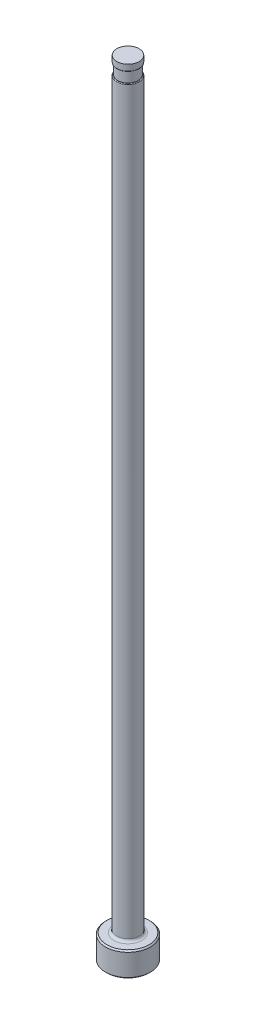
ISO-10303-21;
HEADER;
FILE_DESCRIPTION(('STEP AP214'),'2;1');
FILE_NAME('part.step','',(''),(''),'','','');
FILE_SCHEMA(('AUTOMOTIVE_DESIGN { 1 0 10303 214 1 1 1 1 }'));
ENDSEC;
DATA;
#1=APPLICATION_CONTEXT('core data for automotive mechanical design processes');
#2=APPLICATION_PROTOCOL_DEFINITION('international standard','automotive_design',2000,#1);
#3=PRODUCT_CONTEXT('',#1,'mechanical');
#4=PRODUCT('Part','Part','',(#3));
#5=PRODUCT_RELATED_PRODUCT_CATEGORY('part','',(#4));
#6=PRODUCT_DEFINITION_FORMATION('','',#4);
#7=PRODUCT_DEFINITION_CONTEXT('part definition',#1,'design');
#8=PRODUCT_DEFINITION('design','',#6,#7);
#9=PRODUCT_DEFINITION_SHAPE('','',#8);
#10=(LENGTH_UNIT() NAMED_UNIT(*) SI_UNIT(.MILLI.,.METRE.));
#11=(NAMED_UNIT(*) PLANE_ANGLE_UNIT() SI_UNIT($,.RADIAN.));
#12=(NAMED_UNIT(*) SI_UNIT($,.STERADIAN.) SOLID_ANGLE_UNIT());
#13=UNCERTAINTY_MEASURE_WITH_UNIT(LENGTH_MEASURE(1.E-05),#10,'distance_accuracy_value','');
#14=(GEOMETRIC_REPRESENTATION_CONTEXT(3) GLOBAL_UNCERTAINTY_ASSIGNED_CONTEXT((#13)) GLOBAL_UNIT_ASSIGNED_CONTEXT((#10,
#11,#12)) REPRESENTATION_CONTEXT('',''));
#15=CARTESIAN_POINT('',(0.,0.,0.));
#16=DIRECTION('',(0.,0.,1.));
#17=DIRECTION('',(1.,0.,0.));
#18=AXIS2_PLACEMENT_3D('',#15,#16,#17);
#19=CARTESIAN_POINT('',(-2.18185999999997,151.13,0.));
#20=DIRECTION('',(0.,1.,0.));
#21=DIRECTION('',(0.,0.,1.));
#22=AXIS2_PLACEMENT_3D('',#19,#20,#21);
#23=PLANE('',#22);
#24=CARTESIAN_POINT('',(0.,151.13,0.));
#25=DIRECTION('',(0.,1.,0.));
#26=DIRECTION('',(0.,0.,1.));
#27=AXIS2_PLACEMENT_3D('',#24,#25,#26);
#28=CIRCLE('',#27,2.04215999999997);
#29=CARTESIAN_POINT('',(0.,151.13,2.04215999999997));
#30=VERTEX_POINT('',#29);
#31=EDGE_CURVE('E11',#30,#30,#28,.F.);
#32=ORIENTED_EDGE('',*,*,#31,.T.);
#33=EDGE_LOOP('',(#32));
#34=FACE_BOUND('',#33,.T.);
#35=CARTESIAN_POINT('',(0.,151.13,0.));
#36=DIRECTION('',(0.,1.,0.));
#37=DIRECTION('',(0.,0.,1.));
#38=AXIS2_PLACEMENT_3D('',#35,#36,#37);
#39=CIRCLE('',#38,1.97865999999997);
#40=CARTESIAN_POINT('',(0.,151.13,1.97865999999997));
#41=VERTEX_POINT('',#40);
#42=EDGE_CURVE('E78',#41,#41,#39,.T.);
#43=ORIENTED_EDGE('',*,*,#42,.T.);
#44=EDGE_LOOP('',(#43));
#45=FACE_BOUND('',#44,.T.);
#46=ADVANCED_FACE('F36',(#34,#45),#23,.F.);
#47=CARTESIAN_POINT('',(0.,259.958771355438,0.));
#48=DIRECTION('',(0.,1.,0.));
#49=DIRECTION('',(0.,0.,1.));
#50=AXIS2_PLACEMENT_3D('',#47,#48,#49);
#51=CYLINDRICAL_SURFACE('',#50,2.18185999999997);
#52=DIRECTION('',(0.,1.,0.));
#53=VECTOR('',#52,1.);
#54=CARTESIAN_POINT('',(-1.97865999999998,259.958771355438,-0.919465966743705));
#55=LINE('',#54,#53);
#56=CARTESIAN_POINT('',(-1.97865999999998,148.971,-0.919465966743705));
#57=VERTEX_POINT('',#56);
#58=CARTESIAN_POINT('',(-1.97865999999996,86.614,-0.919465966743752));
#59=VERTEX_POINT('',#58);
#60=EDGE_CURVE('E73',#57,#59,#55,.F.);
#61=ORIENTED_EDGE('',*,*,#60,.F.);
#62=CARTESIAN_POINT('',(0.,148.971,0.));
#63=DIRECTION('',(0.,-1.,0.));
#64=DIRECTION('',(0.,0.,-1.));
#65=AXIS2_PLACEMENT_3D('',#62,#63,#64);
#66=CIRCLE('',#65,2.18185999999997);
#67=CARTESIAN_POINT('',(-1.97865999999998,148.971,0.919465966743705));
#68=VERTEX_POINT('',#67);
#69=EDGE_CURVE('E51',#57,#68,#66,.T.);
#70=ORIENTED_EDGE('',*,*,#69,.T.);
#71=DIRECTION('',(0.,1.,0.));
#72=VECTOR('',#71,1.);
#73=CARTESIAN_POINT('',(-1.97865999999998,259.958771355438,0.919465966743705));
#74=LINE('',#73,#72);
#75=CARTESIAN_POINT('',(-1.97865999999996,86.614,0.919465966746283));
#76=VERTEX_POINT('',#75);
#77=EDGE_CURVE('E84',#76,#68,#74,.T.);
#78=ORIENTED_EDGE('',*,*,#77,.F.);
#79=CARTESIAN_POINT('',(-1.97865999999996,86.614,-0.919465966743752));
#80=CARTESIAN_POINT('',(-1.97865866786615,86.5826405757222,-0.919462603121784));
#81=CARTESIAN_POINT('',(-1.97912506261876,86.5512918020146,-0.918466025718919));
#82=CARTESIAN_POINT('',(-1.98097751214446,86.4887428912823,-0.914466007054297));
#83=CARTESIAN_POINT('',(-1.98236377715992,86.4575427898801,-0.911462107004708));
#84=CARTESIAN_POINT('',(-1.98789143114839,86.3641571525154,-0.899380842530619));
#85=CARTESIAN_POINT('',(-1.99340148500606,86.302411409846,-0.887233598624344));
#86=CARTESIAN_POINT('',(-2.00766626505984,86.1814900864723,-0.854463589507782));
#87=CARTESIAN_POINT('',(-2.01642631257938,86.1223188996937,-0.833826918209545));
#88=CARTESIAN_POINT('',(-2.03642611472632,86.0083500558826,-0.783714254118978));
#89=CARTESIAN_POINT('',(-2.04766149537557,85.9535449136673,-0.754253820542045));
#90=CARTESIAN_POINT('',(-2.06976532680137,85.8574949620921,-0.691040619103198));
#91=CARTESIAN_POINT('',(-2.08046172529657,85.8154280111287,-0.658480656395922));
#92=CARTESIAN_POINT('',(-2.10182499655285,85.737320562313,-0.586722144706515));
#93=CARTESIAN_POINT('',(-2.11249187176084,85.7012795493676,-0.547524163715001));
#94=CARTESIAN_POINT('',(-2.13268121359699,85.6365154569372,-0.4627024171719));
#95=CARTESIAN_POINT('',(-2.14219477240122,85.6078476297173,-0.417033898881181));
#96=CARTESIAN_POINT('',(-2.15871707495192,85.5596764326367,-0.320671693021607));
#97=CARTESIAN_POINT('',(-2.16572797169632,85.5401651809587,-0.269982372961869));
#98=CARTESIAN_POINT('',(-2.17552234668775,85.5133195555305,-0.172335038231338));
#99=CARTESIAN_POINT('',(-2.17874151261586,85.5047183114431,-0.125766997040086));
#100=CARTESIAN_POINT('',(-2.18213487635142,85.4956577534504,-0.0317428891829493));
#101=CARTESIAN_POINT('',(-2.18231070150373,85.4951940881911,0.0157126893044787));
#102=CARTESIAN_POINT('',(-2.17970850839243,85.5021335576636,0.106163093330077));
#103=CARTESIAN_POINT('',(-2.17716289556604,85.5089177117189,0.149213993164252));
#104=CARTESIAN_POINT('',(-2.16974118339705,85.52911834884,0.233509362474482));
#105=CARTESIAN_POINT('',(-2.16486525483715,85.5425343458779,0.274753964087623));
#106=CARTESIAN_POINT('',(-2.15317272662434,85.5757261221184,0.355008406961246));
#107=CARTESIAN_POINT('',(-2.14632875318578,85.5955921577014,0.393976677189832));
#108=CARTESIAN_POINT('',(-2.13136233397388,85.64090710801,0.46823629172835));
#109=CARTESIAN_POINT('',(-2.12323947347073,85.6663578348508,0.50352643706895));
#110=CARTESIAN_POINT('',(-2.1056031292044,85.7246284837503,0.57302033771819));
#111=CARTESIAN_POINT('',(-2.09603057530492,85.7579136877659,0.606817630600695));
#112=CARTESIAN_POINT('',(-2.07698351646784,85.8291137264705,0.66911560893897));
#113=CARTESIAN_POINT('',(-2.0675090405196,85.8670298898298,0.6976147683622));
#114=CARTESIAN_POINT('',(-2.04798045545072,85.9525059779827,0.75318377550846));
#115=CARTESIAN_POINT('',(-2.03805488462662,86.0006575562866,0.779387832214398));
#116=CARTESIAN_POINT('',(-2.02005215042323,86.100471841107,0.824924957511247));
#117=CARTESIAN_POINT('',(-2.01197798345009,86.1521400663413,0.844246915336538));
#118=CARTESIAN_POINT('',(-1.99655433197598,86.2709127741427,0.880207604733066));
#119=CARTESIAN_POINT('',(-1.98987802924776,86.3386743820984,0.895000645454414));
#120=CARTESIAN_POINT('',(-1.98316702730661,86.4414162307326,0.909716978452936));
#121=CARTESIAN_POINT('',(-1.98148063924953,86.4758147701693,0.91337694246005));
#122=CARTESIAN_POINT('',(-1.97922666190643,86.5448033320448,0.918247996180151));
#123=CARTESIAN_POINT('',(-1.97865847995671,86.5793932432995,0.91946038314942));
#124=CARTESIAN_POINT('',(-1.97865999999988,86.6139999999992,0.919465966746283));
#125=B_SPLINE_CURVE_WITH_KNOTS('',3,(#79,#80,#81,#82,#83,#84,#85,#86,#87,#88,#89,#90,#91,#92,
#93,#94,#95,#96,#97,#98,#99,#100,#101,#102,#103,#104,#105,#106,#107,#108,#109,#110,#111,#112,
#113,#114,#115,#116,#117,#118,#119,#120,#121,#122,#123,#124),.UNSPECIFIED.,.F.,.F.,(4,2,2,2,2,2,
2,2,2,2,2,2,2,2,2,2,2,2,2,2,2,2,4),(0.,0.0940372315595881,0.188095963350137,0.376882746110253,
0.565980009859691,0.754745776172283,0.916867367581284,1.07897509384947,1.24226436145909,
1.40541281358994,1.54703759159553,1.68858663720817,1.8189460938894,1.94929599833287,
2.08155476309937,2.21385650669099,2.35846583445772,2.50311675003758,2.66961219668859,
2.83637523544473,3.04438491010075,3.1481998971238,3.25195984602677),.UNSPECIFIED.);
#126=EDGE_CURVE('E81',#59,#76,#125,.T.);
#127=ORIENTED_EDGE('',*,*,#126,.F.);
#128=EDGE_LOOP('',(#61,#70,#78,#127));
#129=FACE_BOUND('',#128,.T.);
#130=CARTESIAN_POINT('',(0.,5.25779999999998,0.));
#131=DIRECTION('',(0.,1.,0.));
#132=DIRECTION('',(0.,0.,1.));
#133=AXIS2_PLACEMENT_3D('',#130,#131,#132);
#134=CIRCLE('',#133,2.18185999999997);
#135=CARTESIAN_POINT('',(0.,5.25779999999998,2.18185999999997));
#136=VERTEX_POINT('',#135);
#137=EDGE_CURVE('E116',#136,#136,#134,.T.);
#138=ORIENTED_EDGE('',*,*,#137,.T.);
#139=EDGE_LOOP('',(#138));
#140=FACE_BOUND('',#139,.T.);
#141=ADVANCED_FACE('F82',(#129,#140),#51,.T.);
#142=CARTESIAN_POINT('',(0.,0.,0.));
#143=DIRECTION('',(0.,-1.,0.));
#144=DIRECTION('',(0.,0.,-1.));
#145=AXIS2_PLACEMENT_3D('',#142,#143,#144);
#146=PLANE('',#145);
#147=CARTESIAN_POINT('',(0.,0.,0.));
#148=DIRECTION('',(0.,-1.,0.));
#149=DIRECTION('',(0.,0.,-1.));
#150=AXIS2_PLACEMENT_3D('',#147,#148,#149);
#151=CIRCLE('',#150,4.10209999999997);
#152=CARTESIAN_POINT('',(0.,0.,-4.10209999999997));
#153=VERTEX_POINT('',#152);
#154=EDGE_CURVE('E113',#153,#153,#151,.T.);
#155=ORIENTED_EDGE('',*,*,#154,.T.);
#156=EDGE_LOOP('',(#155));
#157=FACE_BOUND('',#156,.T.);
#158=ADVANCED_FACE('F192',(#157),#146,.T.);
#159=CARTESIAN_POINT('',(0.,259.958771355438,0.));
#160=DIRECTION('',(0.,1.,0.));
#161=DIRECTION('',(0.,0.,1.));
#162=AXIS2_PLACEMENT_3D('',#159,#160,#161);
#163=CYLINDRICAL_SURFACE('',#162,4.35609999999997);
#164=CARTESIAN_POINT('',(0.,4.49580000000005,0.));
#165=DIRECTION('',(0.,1.,0.));
#166=DIRECTION('',(0.,0.,1.));
#167=AXIS2_PLACEMENT_3D('',#164,#165,#166);
#168=CIRCLE('',#167,4.35609999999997);
#169=CARTESIAN_POINT('',(0.,4.49580000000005,4.35609999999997));
#170=VERTEX_POINT('',#169);
#171=EDGE_CURVE('E110',#170,#170,#168,.F.);
#172=ORIENTED_EDGE('',*,*,#171,.T.);
#173=EDGE_LOOP('',(#172));
#174=FACE_BOUND('',#173,.T.);
#175=CARTESIAN_POINT('',(0.,0.253999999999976,0.));
#176=DIRECTION('',(0.,-1.,0.));
#177=DIRECTION('',(0.,0.,-1.));
#178=AXIS2_PLACEMENT_3D('',#175,#176,#177);
#179=CIRCLE('',#178,4.35609999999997);
#180=CARTESIAN_POINT('',(0.,0.253999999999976,-4.35609999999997));
#181=VERTEX_POINT('',#180);
#182=EDGE_CURVE('E107',#181,#181,#179,.F.);
#183=ORIENTED_EDGE('',*,*,#182,.T.);
#184=EDGE_LOOP('',(#183));
#185=FACE_BOUND('',#184,.T.);
#186=ADVANCED_FACE('F195',(#174,#185),#163,.T.);
#187=CARTESIAN_POINT('',(-4.35609999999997,4.7498,0.));
#188=DIRECTION('',(0.,1.,0.));
#189=DIRECTION('',(0.,0.,1.));
#190=AXIS2_PLACEMENT_3D('',#187,#188,#189);
#191=PLANE('',#190);
#192=CARTESIAN_POINT('',(0.,4.7498,0.));
#193=DIRECTION('',(0.,1.,0.));
#194=DIRECTION('',(0.,0.,1.));
#195=AXIS2_PLACEMENT_3D('',#192,#193,#194);
#196=CIRCLE('',#195,2.68985999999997);
#197=CARTESIAN_POINT('',(0.,4.7498,2.68985999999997));
#198=VERTEX_POINT('',#197);
#199=EDGE_CURVE('E87',#198,#198,#196,.F.);
#200=ORIENTED_EDGE('',*,*,#199,.T.);
#201=EDGE_LOOP('',(#200));
#202=FACE_BOUND('',#201,.T.);
#203=CARTESIAN_POINT('',(0.,4.7498,0.));
#204=DIRECTION('',(0.,1.,0.));
#205=DIRECTION('',(0.,0.,1.));
#206=AXIS2_PLACEMENT_3D('',#203,#204,#205);
#207=CIRCLE('',#206,4.10210000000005);
#208=CARTESIAN_POINT('',(0.,4.7498,4.10210000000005));
#209=VERTEX_POINT('',#208);
#210=EDGE_CURVE('E104',#209,#209,#207,.T.);
#211=ORIENTED_EDGE('',*,*,#210,.T.);
#212=EDGE_LOOP('',(#211));
#213=FACE_BOUND('',#212,.T.);
#214=ADVANCED_FACE('F190',(#202,#213),#191,.T.);
#215=CARTESIAN_POINT('',(0.,4.74980000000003,0.));
#216=DIRECTION('',(0.,-1.,0.));
#217=DIRECTION('',(0.,0.,-1.));
#218=AXIS2_PLACEMENT_3D('',#215,#216,#217);
#219=CONICAL_SURFACE('',#218,4.10210000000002,0.785398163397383);
#220=ORIENTED_EDGE('',*,*,#171,.F.);
#221=EDGE_LOOP('',(#220));
#222=FACE_BOUND('',#221,.T.);
#223=ORIENTED_EDGE('',*,*,#210,.F.);
#224=EDGE_LOOP('',(#223));
#225=FACE_BOUND('',#224,.T.);
#226=ADVANCED_FACE('F186',(#222,#225),#219,.T.);
#227=CARTESIAN_POINT('',(0.,0.253999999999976,0.));
#228=DIRECTION('',(0.,1.,0.));
#229=DIRECTION('',(0.,0.,1.));
#230=AXIS2_PLACEMENT_3D('',#227,#228,#229);
#231=CONICAL_SURFACE('',#230,4.35609999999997,0.785398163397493);
#232=ORIENTED_EDGE('',*,*,#154,.F.);
#233=EDGE_LOOP('',(#232));
#234=FACE_BOUND('',#233,.T.);
#235=ORIENTED_EDGE('',*,*,#182,.F.);
#236=EDGE_LOOP('',(#235));
#237=FACE_BOUND('',#236,.T.);
#238=ADVANCED_FACE('F182',(#234,#237),#231,.T.);
#239=CARTESIAN_POINT('',(0.,5.25779999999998,0.));
#240=DIRECTION('',(0.,1.,0.));
#241=DIRECTION('',(0.,0.,1.));
#242=AXIS2_PLACEMENT_3D('',#239,#240,#241);
#243=TOROIDAL_SURFACE('',#242,2.68985999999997,0.508);
#244=ORIENTED_EDGE('',*,*,#199,.F.);
#245=EDGE_LOOP('',(#244));
#246=FACE_BOUND('',#245,.T.);
#247=ORIENTED_EDGE('',*,*,#137,.F.);
#248=EDGE_LOOP('',(#247));
#249=FACE_BOUND('',#248,.T.);
#250=ADVANCED_FACE('F147',(#246,#249),#243,.F.);
#251=CARTESIAN_POINT('',(-2.18185999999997,149.098,0.));
#252=DIRECTION('',(0.,-1.,0.));
#253=DIRECTION('',(0.,0.,-1.));
#254=AXIS2_PLACEMENT_3D('',#251,#252,#253);
#255=PLANE('',#254);
#256=DIRECTION('',(0.,0.,1.));
#257=VECTOR('',#256,1.);
#258=CARTESIAN_POINT('',(-1.97865999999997,149.098,0.));
#259=LINE('',#258,#257);
#260=CARTESIAN_POINT('',(-1.97865999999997,149.098,0.));
#261=VERTEX_POINT('',#260);
#262=CARTESIAN_POINT('',(-1.97865999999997,149.098,0.554395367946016));
#263=VERTEX_POINT('',#262);
#264=EDGE_CURVE('E90',#261,#263,#259,.T.);
#265=ORIENTED_EDGE('',*,*,#264,.T.);
#266=CARTESIAN_POINT('',(0.,149.098,0.));
#267=DIRECTION('',(0.,-1.,0.));
#268=DIRECTION('',(0.,0.,-1.));
#269=AXIS2_PLACEMENT_3D('',#266,#267,#268);
#270=CIRCLE('',#269,2.05485999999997);
#271=CARTESIAN_POINT('',(-1.97865999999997,149.098,-0.554395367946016));
#272=VERTEX_POINT('',#271);
#273=EDGE_CURVE('E86',#263,#272,#270,.F.);
#274=ORIENTED_EDGE('',*,*,#273,.T.);
#275=EDGE_CURVE('E79',#272,#261,#259,.T.);
#276=ORIENTED_EDGE('',*,*,#275,.T.);
#277=CARTESIAN_POINT('',(0.,149.098,0.));
#278=DIRECTION('',(0.,1.,0.));
#279=DIRECTION('',(0.,0.,1.));
#280=AXIS2_PLACEMENT_3D('',#277,#278,#279);
#281=CIRCLE('',#280,1.97865999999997);
#282=EDGE_CURVE('E101',#261,#261,#281,.T.);
#283=ORIENTED_EDGE('',*,*,#282,.F.);
#284=EDGE_LOOP('',(#265,#274,#276,#283));
#285=FACE_BOUND('',#284,.T.);
#286=ADVANCED_FACE('F144',(#285),#255,.F.);
#287=CARTESIAN_POINT('',(0.,153.448281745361,0.));
#288=DIRECTION('',(0.,1.,0.));
#289=DIRECTION('',(0.,0.,1.));
#290=AXIS2_PLACEMENT_3D('',#287,#288,#289);
#291=CYLINDRICAL_SURFACE('',#290,1.97865999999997);
#292=ORIENTED_EDGE('',*,*,#42,.F.);
#293=EDGE_LOOP('',(#292));
#294=FACE_BOUND('',#293,.T.);
#295=ORIENTED_EDGE('',*,*,#282,.T.);
#296=EDGE_LOOP('',(#295));
#297=FACE_BOUND('',#296,.T.);
#298=ADVANCED_FACE('F141',(#294,#297),#291,.T.);
#299=CARTESIAN_POINT('',(-1.97865999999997,150.114,-4.35609999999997));
#300=DIRECTION('',(1.,0.,0.));
#301=DIRECTION('',(0.,1.,0.));
#302=AXIS2_PLACEMENT_3D('',#299,#300,#301);
#303=PLANE('',#302);
#304=ORIENTED_EDGE('',*,*,#275,.F.);
#305=CARTESIAN_POINT('',(-1.97865999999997,149.098,-0.554395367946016));
#306=CARTESIAN_POINT('',(-1.97865999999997,149.097980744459,-0.575592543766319));
#307=CARTESIAN_POINT('',(-1.97865999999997,149.097610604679,-0.596810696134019));
#308=CARTESIAN_POINT('',(-1.97865999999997,149.095797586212,-0.639399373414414));
#309=CARTESIAN_POINT('',(-1.97865999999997,149.094344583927,-0.660769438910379));
#310=CARTESIAN_POINT('',(-1.97865999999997,149.089969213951,-0.703485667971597));
#311=CARTESIAN_POINT('',(-1.97865999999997,149.087038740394,-0.724831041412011));
#312=CARTESIAN_POINT('',(-1.97865999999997,149.079100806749,-0.767087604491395));
#313=CARTESIAN_POINT('',(-1.97865999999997,149.074102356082,-0.788000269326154));
#314=CARTESIAN_POINT('',(-1.97865999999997,149.065075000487,-0.815870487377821));
#315=CARTESIAN_POINT('',(-1.97865999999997,149.062437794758,-0.823276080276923));
#316=CARTESIAN_POINT('',(-1.97865999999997,149.05661239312,-0.837911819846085));
#317=CARTESIAN_POINT('',(-1.97865999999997,149.053421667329,-0.845140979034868));
#318=CARTESIAN_POINT('',(-1.97865999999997,149.045442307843,-0.861139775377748));
#319=CARTESIAN_POINT('',(-1.97865999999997,149.040454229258,-0.869811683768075));
#320=CARTESIAN_POINT('',(-1.97865999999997,149.029037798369,-0.886141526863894));
#321=CARTESIAN_POINT('',(-1.97865999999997,149.022621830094,-0.893807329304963));
#322=CARTESIAN_POINT('',(-1.97865999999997,149.012411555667,-0.902964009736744));
#323=CARTESIAN_POINT('',(-1.97865999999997,149.00943102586,-0.905353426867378));
#324=CARTESIAN_POINT('',(-1.97865999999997,149.003163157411,-0.909703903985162));
#325=CARTESIAN_POINT('',(-1.97865999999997,148.999875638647,-0.911664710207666));
#326=CARTESIAN_POINT('',(-1.97865999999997,148.992965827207,-0.91503596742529));
#327=CARTESIAN_POINT('',(-1.97865999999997,148.989339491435,-0.916438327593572));
#328=CARTESIAN_POINT('',(-1.97865999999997,148.981884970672,-0.918487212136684));
#329=CARTESIAN_POINT('',(-1.97865999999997,148.978057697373,-0.919136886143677));
#330=CARTESIAN_POINT('',(-1.97865999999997,148.97314216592,-0.91943429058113));
#331=CARTESIAN_POINT('',(-1.97865999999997,148.972070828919,-0.919466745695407));
#332=CARTESIAN_POINT('',(-1.97865999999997,148.971,-0.919465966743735));
#333=B_SPLINE_CURVE_WITH_KNOTS('',3,(#305,#306,#307,#308,#309,#310,#311,#312,#313,#314,#315,
#316,#317,#318,#319,#320,#321,#322,#323,#324,#325,#326,#327,#328,#329,#330,#331,#332),
.UNSPECIFIED.,.F.,.F.,(4,2,2,2,2,2,2,2,2,2,2,2,2,4),(0.,0.0636224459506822,0.127847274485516,
0.192428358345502,0.256731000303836,0.28029891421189,0.30397752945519,0.33391323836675,
0.36359878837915,0.375030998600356,0.386469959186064,0.398069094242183,0.40961951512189,
0.412833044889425),.UNSPECIFIED.);
#334=EDGE_CURVE('E59',#272,#57,#333,.T.);
#335=ORIENTED_EDGE('',*,*,#334,.T.);
#336=ORIENTED_EDGE('',*,*,#60,.T.);
#337=DIRECTION('',(0.,0.,1.));
#338=VECTOR('',#337,1.);
#339=CARTESIAN_POINT('',(-1.97865999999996,86.614,-4.35609999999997));
#340=LINE('',#339,#338);
#341=EDGE_CURVE('E77',#59,#76,#340,.T.);
#342=ORIENTED_EDGE('',*,*,#341,.T.);
#343=ORIENTED_EDGE('',*,*,#77,.T.);
#344=CARTESIAN_POINT('',(-1.97865999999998,148.971,0.919465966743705));
#345=CARTESIAN_POINT('',(-1.97865999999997,148.974299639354,0.919474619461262));
#346=CARTESIAN_POINT('',(-1.97865999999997,148.977588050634,0.919161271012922));
#347=CARTESIAN_POINT('',(-1.97865999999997,148.984024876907,0.917970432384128));
#348=CARTESIAN_POINT('',(-1.97865999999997,148.987174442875,0.917099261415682));
#349=CARTESIAN_POINT('',(-1.97865999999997,148.994004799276,0.914610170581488));
#350=CARTESIAN_POINT('',(-1.97865999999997,148.997638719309,0.912865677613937));
#351=CARTESIAN_POINT('',(-1.97865999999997,149.004587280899,0.908811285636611));
#352=CARTESIAN_POINT('',(-1.97865999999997,149.007900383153,0.906498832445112));
#353=CARTESIAN_POINT('',(-1.97865999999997,149.016031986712,0.899998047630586));
#354=CARTESIAN_POINT('',(-1.97865999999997,149.020602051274,0.895502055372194));
#355=CARTESIAN_POINT('',(-1.97865999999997,149.029028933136,0.885897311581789));
#356=CARTESIAN_POINT('',(-1.97865999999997,149.032884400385,0.880787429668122));
#357=CARTESIAN_POINT('',(-1.97865999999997,149.043507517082,0.865009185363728));
#358=CARTESIAN_POINT('',(-1.97865999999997,149.049441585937,0.853786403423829));
#359=CARTESIAN_POINT('',(-1.97865999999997,149.059811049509,0.830611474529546));
#360=CARTESIAN_POINT('',(-1.97865999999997,149.064233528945,0.818654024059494));
#361=CARTESIAN_POINT('',(-1.97865999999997,149.074746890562,0.785643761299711));
#362=CARTESIAN_POINT('',(-1.97865999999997,149.079742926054,0.764247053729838));
#363=CARTESIAN_POINT('',(-1.97865999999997,149.087629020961,0.721022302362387));
#364=CARTESIAN_POINT('',(-1.97865999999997,149.090509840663,0.699192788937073));
#365=CARTESIAN_POINT('',(-1.97865999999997,149.094633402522,0.656787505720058));
#366=CARTESIAN_POINT('',(-1.97865999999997,149.095968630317,0.636220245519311));
#367=CARTESIAN_POINT('',(-1.97865999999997,149.097639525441,0.595227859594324));
#368=CARTESIAN_POINT('',(-1.97865999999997,149.097984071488,0.57480311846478));
#369=CARTESIAN_POINT('',(-1.97865999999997,149.098,0.55439536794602));
#370=B_SPLINE_CURVE_WITH_KNOTS('',3,(#344,#345,#346,#347,#348,#349,#350,#351,#352,#353,#354,
#355,#356,#357,#358,#359,#360,#361,#362,#363,#364,#365,#366,#367,#368,#369),.UNSPECIFIED.,.F.,
.F.,(4,2,2,2,2,2,2,2,2,2,2,2,4),(0.,0.00986593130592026,0.0196220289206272,0.0316477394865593,
0.043728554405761,0.062852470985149,0.0820121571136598,0.119885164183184,0.158074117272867,
0.223787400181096,0.28978605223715,0.351589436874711,0.412837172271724),.UNSPECIFIED.);
#371=EDGE_CURVE('E172',#68,#263,#370,.T.);
#372=ORIENTED_EDGE('',*,*,#371,.T.);
#373=ORIENTED_EDGE('',*,*,#264,.F.);
#374=EDGE_LOOP('',(#304,#335,#336,#342,#343,#372,#373));
#375=FACE_BOUND('',#374,.T.);
#376=ADVANCED_FACE('F75',(#375),#303,.F.);
#377=CARTESIAN_POINT('',(-5.15365999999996,86.614,-4.35609999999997));
#378=DIRECTION('',(0.,0.,1.));
#379=DIRECTION('',(1.,0.,0.));
#380=AXIS2_PLACEMENT_3D('',#377,#378,#379);
#381=CYLINDRICAL_SURFACE('',#380,3.175);
#382=ORIENTED_EDGE('',*,*,#341,.F.);
#383=ORIENTED_EDGE('',*,*,#126,.T.);
#384=EDGE_LOOP('',(#382,#383));
#385=FACE_BOUND('',#384,.T.);
#386=ADVANCED_FACE('F89',(#385),#381,.F.);
#387=CARTESIAN_POINT('',(0.,152.687735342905,0.));
#388=DIRECTION('',(0.,1.,0.));
#389=DIRECTION('',(0.,0.,1.));
#390=AXIS2_PLACEMENT_3D('',#387,#388,#389);
#391=CYLINDRICAL_SURFACE('',#390,2.16915999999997);
#392=CARTESIAN_POINT('',(0.,151.257,0.));
#393=DIRECTION('',(0.,1.,0.));
#394=DIRECTION('',(0.,0.,1.));
#395=AXIS2_PLACEMENT_3D('',#392,#393,#394);
#396=CIRCLE('',#395,2.16915999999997);
#397=CARTESIAN_POINT('',(0.,151.257,2.16915999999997));
#398=VERTEX_POINT('',#397);
#399=EDGE_CURVE('E44',#398,#398,#396,.T.);
#400=ORIENTED_EDGE('',*,*,#399,.T.);
#401=EDGE_LOOP('',(#400));
#402=FACE_BOUND('',#401,.T.);
#403=CARTESIAN_POINT('',(0.,152.4,0.));
#404=DIRECTION('',(0.,1.,0.));
#405=DIRECTION('',(0.,0.,1.));
#406=AXIS2_PLACEMENT_3D('',#403,#404,#405);
#407=CIRCLE('',#406,2.16915999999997);
#408=CARTESIAN_POINT('',(0.,152.4,2.16915999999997));
#409=VERTEX_POINT('',#408);
#410=EDGE_CURVE('E91',#409,#409,#407,.T.);
#411=ORIENTED_EDGE('',*,*,#410,.F.);
#412=EDGE_LOOP('',(#411));
#413=FACE_BOUND('',#412,.T.);
#414=ADVANCED_FACE('F135',(#402,#413),#391,.T.);
#415=CARTESIAN_POINT('',(-2.18185999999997,152.4,0.));
#416=DIRECTION('',(0.,1.,0.));
#417=DIRECTION('',(0.,0.,1.));
#418=AXIS2_PLACEMENT_3D('',#415,#416,#417);
#419=PLANE('',#418);
#420=ORIENTED_EDGE('',*,*,#410,.T.);
#421=EDGE_LOOP('',(#420));
#422=FACE_BOUND('',#421,.T.);
#423=ADVANCED_FACE('F149',(#422),#419,.T.);
#424=CARTESIAN_POINT('',(0.,148.971,0.));
#425=DIRECTION('',(0.,-1.,0.));
#426=DIRECTION('',(0.,0.,-1.));
#427=AXIS2_PLACEMENT_3D('',#424,#425,#426);
#428=TOROIDAL_SURFACE('',#427,2.05485999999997,0.127);
#429=ORIENTED_EDGE('',*,*,#371,.F.);
#430=ORIENTED_EDGE('',*,*,#69,.F.);
#431=ORIENTED_EDGE('',*,*,#334,.F.);
#432=ORIENTED_EDGE('',*,*,#273,.F.);
#433=EDGE_LOOP('',(#429,#430,#431,#432));
#434=FACE_BOUND('',#433,.T.);
#435=ADVANCED_FACE('F151',(#434),#428,.T.);
#436=CARTESIAN_POINT('',(0.,151.257,0.));
#437=DIRECTION('',(0.,1.,0.));
#438=DIRECTION('',(0.,0.,1.));
#439=AXIS2_PLACEMENT_3D('',#436,#437,#438);
#440=TOROIDAL_SURFACE('',#439,2.04215999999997,0.127);
#441=ORIENTED_EDGE('',*,*,#31,.F.);
#442=EDGE_LOOP('',(#441));
#443=FACE_BOUND('',#442,.T.);
#444=ORIENTED_EDGE('',*,*,#399,.F.);
#445=EDGE_LOOP('',(#444));
#446=FACE_BOUND('',#445,.T.);
#447=ADVANCED_FACE('F38',(#443,#446),#440,.T.);
#448=CLOSED_SHELL('',(#46,#141,#158,#186,#214,#226,#238,#250,#286,#298,#376,#386,#414,#423,#435,#447));
#449=MANIFOLD_SOLID_BREP('B2',#448);
#450=ADVANCED_BREP_SHAPE_REPRESENTATION('',(#18,#449),#14);
#451=SHAPE_DEFINITION_REPRESENTATION(#9,#450);
ENDSEC;
END-ISO-10303-21;
